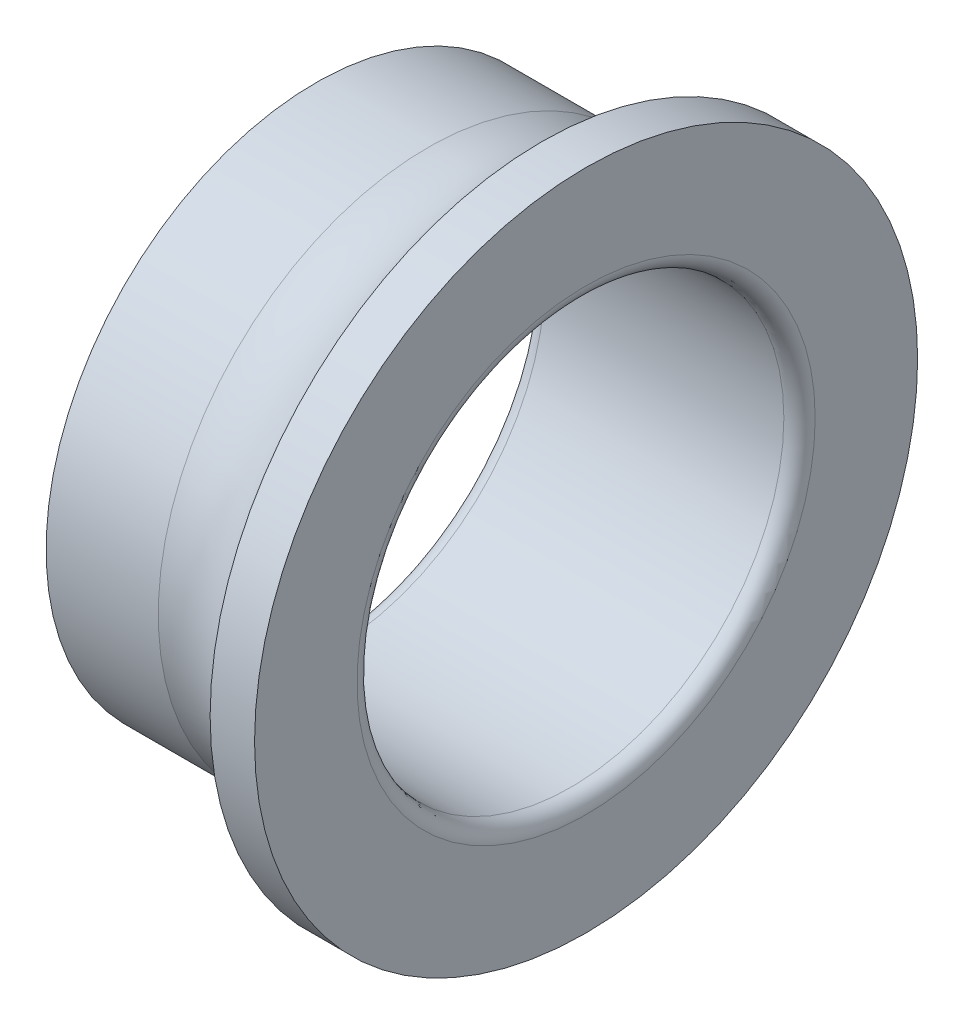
from build123d import *


with BuildPart() as part:
    # Croquis1 → Revoluci_n1 (revolve)
    with BuildSketch(Plane.XY, mode=Mode.PRIVATE) as revoluci_n1_sk:
        with BuildLine():
            Line((1.1, 15), (17.9, 15))
            ThreePointArc((17.9, 15), (18.677817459, 15.322182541), (19, 16.1))
            Line((19, 16.1), (19, 23.3))
            Line((19, 23.3), (15.878244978, 23.3))
            ThreePointArc((15.878244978, 23.3), (12.724041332, 19.573148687), (7.881510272, 18.95))
            Line((7.881510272, 18.95), (0, 18.95))
            Line((0, 18.95), (0, 16.1))
            ThreePointArc((0, 16.1), (0.322182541, 15.322182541), (1.1, 15))
        make_face()
    revolve(revoluci_n1_sk.sketch.rotate(Axis((19, 0, 0), (-1, 0, 0)), 90), axis=Axis((19, 0, 0), (-1, 0, 0)))


solid = part.part
